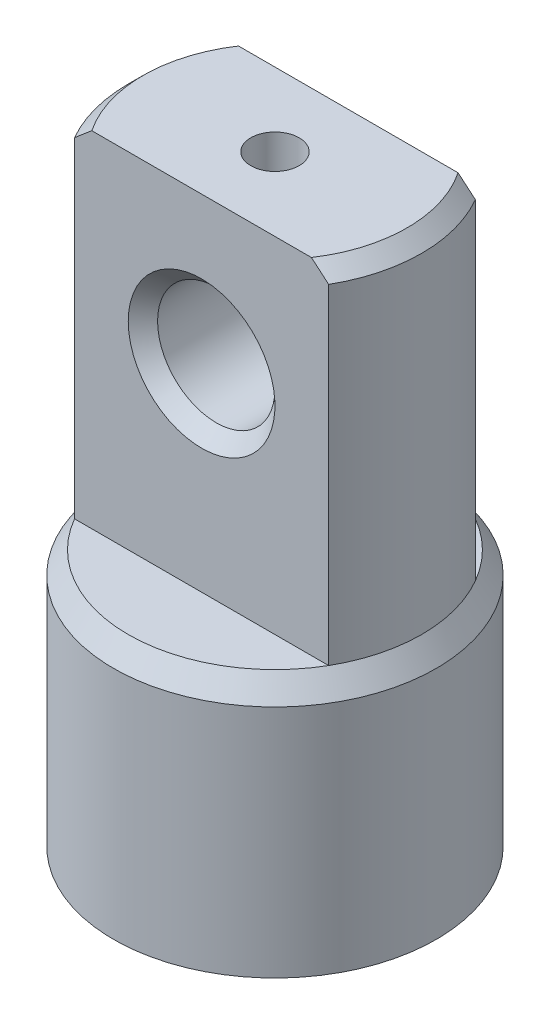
from build123d import *

# Parameters (mm, degrees)
CUT_EXTRUDE3_DEPTH       = 23.5
CHAMFER1_SIZE            = 1
F_8_0_8_DIAMETER_HOLE1_D = 8
CHAMFER2_SIZE            = 1
M4_TAPPED_HOLE1_REACH    = 45.852
M4_TAPPED_HOLE1_BORE_R   = 1.65


with BuildPart() as part:
    # Sketch1 → Revolve1 (revolve)
    with BuildSketch(Plane.XY, mode=Mode.PRIVATE) as revolve1_sk:
        Polygon((0, 0), (11, 0), (11, 16), (10, 17.5), (10, 41), (0, 41), align=None)
    revolve(revolve1_sk.sketch.rotate(Axis((0, 0, 0), (0, 1, 0)), 90), axis=Axis((0, 0, 0), (0, 1, 0)))

    # Sketch3 → Cut-Extrude3 (cut)
    with BuildSketch(Plane(origin=(0, 41, 0), x_dir=(-1, 0, 0), z_dir=(0, 1, 0))):
        with BuildLine():
            Line((9.797958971, -5), (-9.797958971, -5))
            ThreePointArc((-9.797958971, -5), (0, -11), (9.797958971, -5))
        make_face()
        with BuildLine():
            Line((9.797958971, 5), (-9.797958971, 5))
            ThreePointArc((-9.797958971, 5), (0, 11), (9.797958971, 5))
        make_face()
    extrude(amount=-CUT_EXTRUDE3_DEPTH, mode=Mode.SUBTRACT)

    # Chamfer1
    chamfer1_edges = [part.edges().sort_by_distance(p)[0] for p in [
        (-10, 41, 0),
        (10, 41, 0),
    ]]
    chamfer(chamfer1_edges, length=CHAMFER1_SIZE)

    # 8.0 _8_ Diameter Hole1 (through all)
    with Locations(Plane.XY.offset(5)):
        with Locations((0, 31)):
            Hole(F_8_0_8_DIAMETER_HOLE1_D / 2)

    # Chamfer2
    chamfer2_edges = [part.edges().sort_by_distance(p)[0] for p in [
        (4, 31, 5),
        (4, 31, -5),
    ]]
    chamfer(chamfer2_edges, length=CHAMFER2_SIZE)

    # M4 Tapped Hole1 bore → M4 Tapped Hole1 (cut, up to next)
    with BuildSketch(Plane(origin=(0, 41, 0), x_dir=(-1, 0, 0), z_dir=(0, 1, 0)), mode=Mode.PRIVATE) as m4_tapped_hole1_sk1:
        Circle(M4_TAPPED_HOLE1_BORE_R)
    m4_tapped_hole1_tool1 = extrude(m4_tapped_hole1_sk1.sketch, amount=-M4_TAPPED_HOLE1_REACH, mode=Mode.PRIVATE) & part.part
    add(m4_tapped_hole1_tool1.solids().sort_by_distance((0, 41, 0))[0], mode=Mode.SUBTRACT)


solid = part.part
